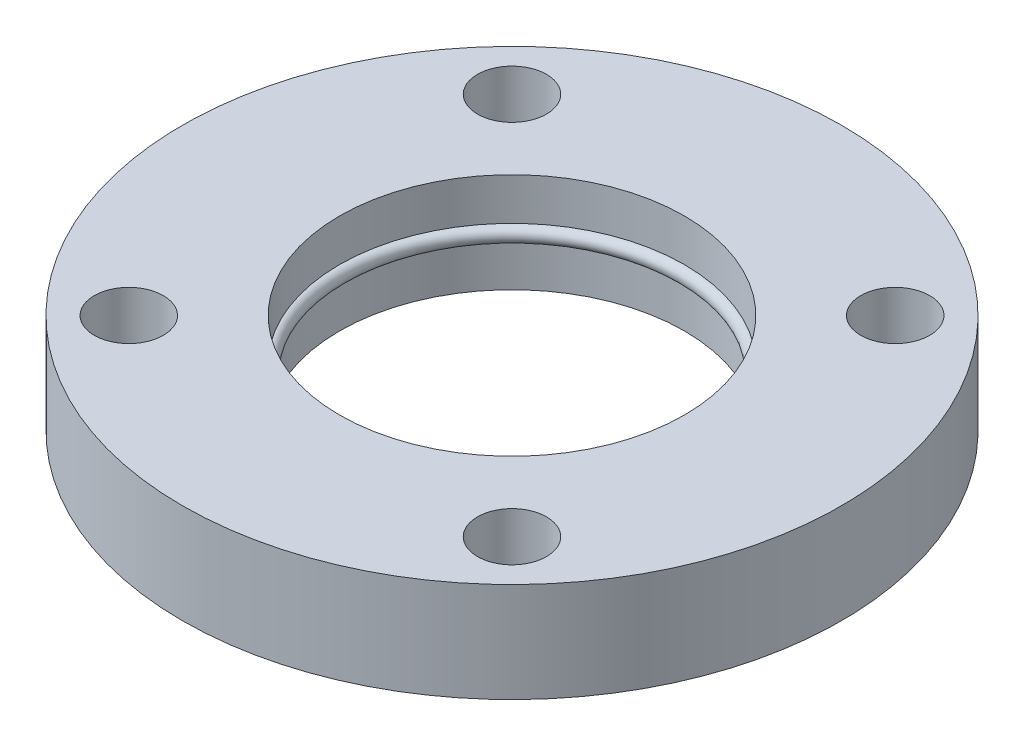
from build123d import *

# Parameters (mm, degrees)
SKETCH2_R           = 43
SKETCH2_R_2         = 22.5
SKETCH2_R_3         = 4.5
BOSS_EXTRUDE1_DEPTH = 6.5
SKETCH3_R           = 1


with BuildPart() as part:
    # Sketch2 → Boss-Extrude1 (new, symmetric)
    with BuildSketch(Plane(origin=(0, 0, 0), x_dir=(1, 0, 0), z_dir=(0, 1, 0))):
        with Locations(Location((0, 0, 0), (0, 0, 90))):
            Circle(SKETCH2_R)
        with Locations(Location((0, 0, 0), (0, 0, 90))):
            Circle(SKETCH2_R_2, mode=Mode.SUBTRACT)
        with Locations(Location((-25, 25, 0), (0, 0, 90))):
            Circle(SKETCH2_R_3, mode=Mode.SUBTRACT)
        with Locations(Location((25, 25, 0), (0, 0, 90))):
            Circle(SKETCH2_R_3, mode=Mode.SUBTRACT)
        with Locations(Location((25, -25, 0), (0, 0, 90))):
            Circle(SKETCH2_R_3, mode=Mode.SUBTRACT)
        with Locations(Location((-25, -25, 0), (0, 0, 90))):
            Circle(SKETCH2_R_3, mode=Mode.SUBTRACT)
    extrude(amount=BOSS_EXTRUDE1_DEPTH, both=True)

    # Sketch3 → Revolve2 (revolve)
    with BuildSketch(Plane.XY, mode=Mode.PRIVATE) as revolve2_sk:
        with Locations((-22.5, 0)):
            Circle(SKETCH3_R)
    revolve(revolve2_sk.sketch.rotate(Axis((0, 0, 0), (0, 1, 0)), 270), axis=Axis((0, 0, 0), (0, 1, 0)))


solid = part.part
